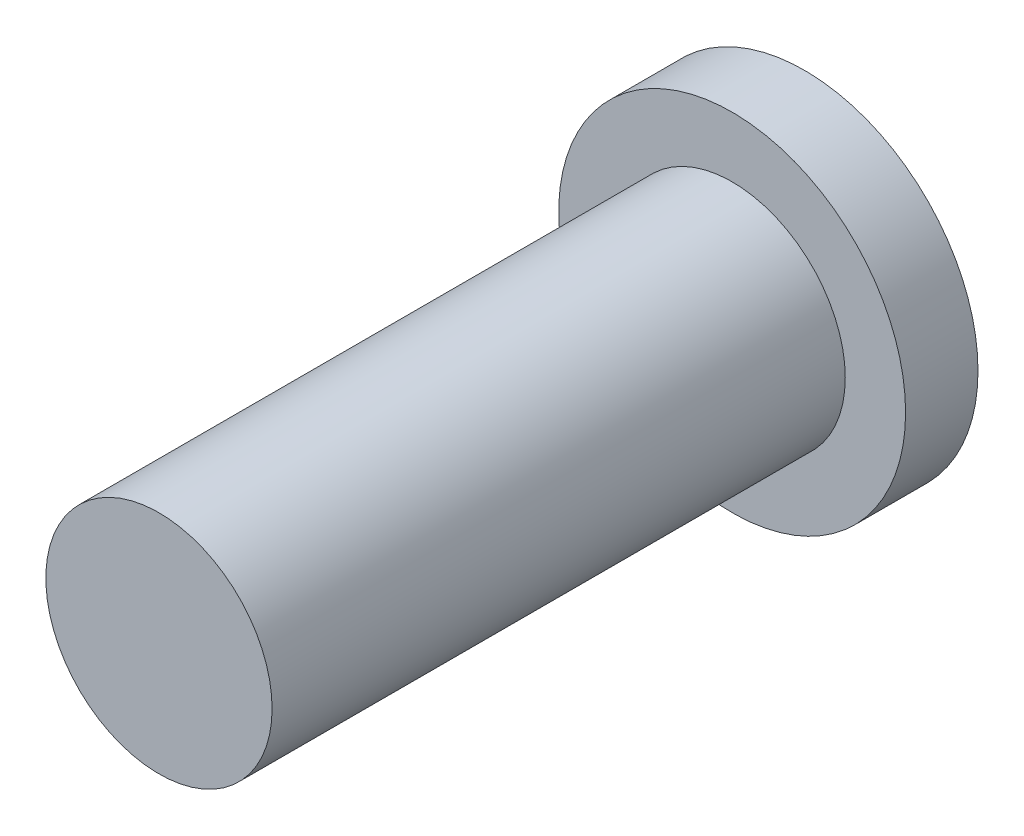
ISO-10303-21;
HEADER;
FILE_DESCRIPTION(('STEP AP214'),'2;1');
FILE_NAME('part.step','',(''),(''),'','','');
FILE_SCHEMA(('AUTOMOTIVE_DESIGN { 1 0 10303 214 1 1 1 1 }'));
ENDSEC;
DATA;
#1=APPLICATION_CONTEXT('core data for automotive mechanical design processes');
#2=APPLICATION_PROTOCOL_DEFINITION('international standard','automotive_design',2000,#1);
#3=PRODUCT_CONTEXT('',#1,'mechanical');
#4=PRODUCT('Part','Part','',(#3));
#5=PRODUCT_RELATED_PRODUCT_CATEGORY('part','',(#4));
#6=PRODUCT_DEFINITION_FORMATION('','',#4);
#7=PRODUCT_DEFINITION_CONTEXT('part definition',#1,'design');
#8=PRODUCT_DEFINITION('design','',#6,#7);
#9=PRODUCT_DEFINITION_SHAPE('','',#8);
#10=(LENGTH_UNIT() NAMED_UNIT(*) SI_UNIT(.MILLI.,.METRE.));
#11=(NAMED_UNIT(*) PLANE_ANGLE_UNIT() SI_UNIT($,.RADIAN.));
#12=(NAMED_UNIT(*) SI_UNIT($,.STERADIAN.) SOLID_ANGLE_UNIT());
#13=UNCERTAINTY_MEASURE_WITH_UNIT(LENGTH_MEASURE(1.E-05),#10,'distance_accuracy_value','');
#14=(GEOMETRIC_REPRESENTATION_CONTEXT(3) GLOBAL_UNCERTAINTY_ASSIGNED_CONTEXT((#13)) GLOBAL_UNIT_ASSIGNED_CONTEXT((#10,
#11,#12)) REPRESENTATION_CONTEXT('',''));
#15=CARTESIAN_POINT('',(0.,0.,0.));
#16=DIRECTION('',(0.,0.,1.));
#17=DIRECTION('',(1.,0.,0.));
#18=AXIS2_PLACEMENT_3D('',#15,#16,#17);
#19=CARTESIAN_POINT('',(0.,0.,0.6096));
#20=DIRECTION('',(0.,0.,1.));
#21=DIRECTION('',(1.,0.,0.));
#22=AXIS2_PLACEMENT_3D('',#19,#20,#21);
#23=PLANE('',#22);
#24=CARTESIAN_POINT('',(0.,0.,0.6096));
#25=DIRECTION('',(0.,0.,1.));
#26=DIRECTION('',(1.,0.,0.));
#27=AXIS2_PLACEMENT_3D('',#24,#25,#26);
#28=CIRCLE('',#27,1.4605);
#29=CARTESIAN_POINT('',(1.4605,0.,0.6096));
#30=VERTEX_POINT('',#29);
#31=EDGE_CURVE('E11',#30,#30,#28,.T.);
#32=ORIENTED_EDGE('',*,*,#31,.T.);
#33=EDGE_LOOP('',(#32));
#34=FACE_BOUND('',#33,.T.);
#35=CARTESIAN_POINT('',(0.,0.,0.6096));
#36=DIRECTION('',(0.,0.,1.));
#37=DIRECTION('',(1.,0.,0.));
#38=AXIS2_PLACEMENT_3D('',#35,#36,#37);
#39=CIRCLE('',#38,0.9525);
#40=CARTESIAN_POINT('',(0.9525,0.,0.6096));
#41=VERTEX_POINT('',#40);
#42=EDGE_CURVE('E189',#41,#41,#39,.T.);
#43=ORIENTED_EDGE('',*,*,#42,.F.);
#44=EDGE_LOOP('',(#43));
#45=FACE_BOUND('',#44,.T.);
#46=ADVANCED_FACE('F33',(#34,#45),#23,.T.);
#47=CARTESIAN_POINT('',(0.,0.,0.6096));
#48=DIRECTION('',(0.,0.,-1.));
#49=DIRECTION('',(-1.,0.,0.));
#50=AXIS2_PLACEMENT_3D('',#47,#48,#49);
#51=CYLINDRICAL_SURFACE('',#50,1.4605);
#52=ORIENTED_EDGE('',*,*,#31,.F.);
#53=EDGE_LOOP('',(#52));
#54=FACE_BOUND('',#53,.T.);
#55=CARTESIAN_POINT('',(0.,0.,0.));
#56=DIRECTION('',(0.,0.,1.));
#57=DIRECTION('',(1.,0.,0.));
#58=AXIS2_PLACEMENT_3D('',#55,#56,#57);
#59=CIRCLE('',#58,1.4605);
#60=CARTESIAN_POINT('',(1.4605,0.,0.));
#61=VERTEX_POINT('',#60);
#62=EDGE_CURVE('E37',#61,#61,#59,.T.);
#63=ORIENTED_EDGE('',*,*,#62,.T.);
#64=EDGE_LOOP('',(#63));
#65=FACE_BOUND('',#64,.T.);
#66=ADVANCED_FACE('F35',(#54,#65),#51,.T.);
#67=CARTESIAN_POINT('',(0.,0.,0.));
#68=DIRECTION('',(0.,0.,1.));
#69=DIRECTION('',(1.,0.,0.));
#70=AXIS2_PLACEMENT_3D('',#67,#68,#69);
#71=PLANE('',#70);
#72=DIRECTION('',(-1.,0.,0.));
#73=VECTOR('',#72,1.);
#74=CARTESIAN_POINT('',(0.5715,-0.1905,0.));
#75=LINE('',#74,#73);
#76=CARTESIAN_POINT('',(0.5715,-0.1905,0.));
#77=VERTEX_POINT('',#76);
#78=CARTESIAN_POINT('',(0.1905,-0.1905,0.));
#79=VERTEX_POINT('',#78);
#80=EDGE_CURVE('E158',#77,#79,#75,.T.);
#81=ORIENTED_EDGE('',*,*,#80,.F.);
#82=DIRECTION('',(0.,-1.,0.));
#83=VECTOR('',#82,1.);
#84=CARTESIAN_POINT('',(0.5715,0.1905,0.));
#85=LINE('',#84,#83);
#86=CARTESIAN_POINT('',(0.5715,0.1905,0.));
#87=VERTEX_POINT('',#86);
#88=EDGE_CURVE('E48',#87,#77,#85,.T.);
#89=ORIENTED_EDGE('',*,*,#88,.F.);
#90=DIRECTION('',(1.,0.,0.));
#91=VECTOR('',#90,1.);
#92=CARTESIAN_POINT('',(0.5715,0.1905,0.));
#93=LINE('',#92,#91);
#94=CARTESIAN_POINT('',(0.1905,0.1905,0.));
#95=VERTEX_POINT('',#94);
#96=EDGE_CURVE('E185',#95,#87,#93,.T.);
#97=ORIENTED_EDGE('',*,*,#96,.F.);
#98=DIRECTION('',(0.,-1.,0.));
#99=VECTOR('',#98,1.);
#100=CARTESIAN_POINT('',(0.1905,0.5715,0.));
#101=LINE('',#100,#99);
#102=CARTESIAN_POINT('',(0.1905,0.5715,0.));
#103=VERTEX_POINT('',#102);
#104=EDGE_CURVE('E183',#103,#95,#101,.T.);
#105=ORIENTED_EDGE('',*,*,#104,.F.);
#106=DIRECTION('',(1.,0.,0.));
#107=VECTOR('',#106,1.);
#108=CARTESIAN_POINT('',(0.1905,0.5715,0.));
#109=LINE('',#108,#107);
#110=CARTESIAN_POINT('',(-0.1905,0.5715,0.));
#111=VERTEX_POINT('',#110);
#112=EDGE_CURVE('E132',#111,#103,#109,.T.);
#113=ORIENTED_EDGE('',*,*,#112,.F.);
#114=DIRECTION('',(0.,1.,0.));
#115=VECTOR('',#114,1.);
#116=CARTESIAN_POINT('',(-0.1905,0.5715,0.));
#117=LINE('',#116,#115);
#118=CARTESIAN_POINT('',(-0.1905,0.1905,0.));
#119=VERTEX_POINT('',#118);
#120=EDGE_CURVE('E179',#119,#111,#117,.T.);
#121=ORIENTED_EDGE('',*,*,#120,.F.);
#122=DIRECTION('',(1.,0.,0.));
#123=VECTOR('',#122,1.);
#124=CARTESIAN_POINT('',(-0.1905,0.1905,0.));
#125=LINE('',#124,#123);
#126=CARTESIAN_POINT('',(-0.5715,0.1905,0.));
#127=VERTEX_POINT('',#126);
#128=EDGE_CURVE('E176',#127,#119,#125,.T.);
#129=ORIENTED_EDGE('',*,*,#128,.F.);
#130=DIRECTION('',(0.,1.,0.));
#131=VECTOR('',#130,1.);
#132=CARTESIAN_POINT('',(-0.5715,0.1905,0.));
#133=LINE('',#132,#131);
#134=CARTESIAN_POINT('',(-0.5715,-0.1905,0.));
#135=VERTEX_POINT('',#134);
#136=EDGE_CURVE('E173',#135,#127,#133,.T.);
#137=ORIENTED_EDGE('',*,*,#136,.F.);
#138=DIRECTION('',(-1.,0.,0.));
#139=VECTOR('',#138,1.);
#140=CARTESIAN_POINT('',(-0.1905,-0.1905,0.));
#141=LINE('',#140,#139);
#142=CARTESIAN_POINT('',(-0.1905,-0.1905,0.));
#143=VERTEX_POINT('',#142);
#144=EDGE_CURVE('E170',#143,#135,#141,.T.);
#145=ORIENTED_EDGE('',*,*,#144,.F.);
#146=DIRECTION('',(0.,1.,0.));
#147=VECTOR('',#146,1.);
#148=CARTESIAN_POINT('',(-0.1905,-0.1905,0.));
#149=LINE('',#148,#147);
#150=CARTESIAN_POINT('',(-0.1905,-0.5715,0.));
#151=VERTEX_POINT('',#150);
#152=EDGE_CURVE('E167',#151,#143,#149,.T.);
#153=ORIENTED_EDGE('',*,*,#152,.F.);
#154=DIRECTION('',(-1.,0.,0.));
#155=VECTOR('',#154,1.);
#156=CARTESIAN_POINT('',(0.1905,-0.5715,0.));
#157=LINE('',#156,#155);
#158=CARTESIAN_POINT('',(0.1905,-0.5715,0.));
#159=VERTEX_POINT('',#158);
#160=EDGE_CURVE('E164',#159,#151,#157,.T.);
#161=ORIENTED_EDGE('',*,*,#160,.F.);
#162=DIRECTION('',(0.,-1.,0.));
#163=VECTOR('',#162,1.);
#164=CARTESIAN_POINT('',(0.1905,-0.1905,0.));
#165=LINE('',#164,#163);
#166=EDGE_CURVE('E161',#79,#159,#165,.T.);
#167=ORIENTED_EDGE('',*,*,#166,.F.);
#168=EDGE_LOOP('',(#81,#89,#97,#105,#113,#121,#129,#137,#145,#153,#161,#167));
#169=FACE_BOUND('',#168,.T.);
#170=ORIENTED_EDGE('',*,*,#62,.F.);
#171=EDGE_LOOP('',(#170));
#172=FACE_BOUND('',#171,.T.);
#173=ADVANCED_FACE('F221',(#169,#172),#71,.F.);
#174=CARTESIAN_POINT('',(0.,0.,5.4356));
#175=DIRECTION('',(0.,0.,-1.));
#176=DIRECTION('',(-1.,0.,0.));
#177=AXIS2_PLACEMENT_3D('',#174,#175,#176);
#178=CYLINDRICAL_SURFACE('',#177,0.9525);
#179=CARTESIAN_POINT('',(0.,0.,5.4356));
#180=DIRECTION('',(0.,0.,1.));
#181=DIRECTION('',(1.,0.,0.));
#182=AXIS2_PLACEMENT_3D('',#179,#180,#181);
#183=CIRCLE('',#182,0.9525);
#184=CARTESIAN_POINT('',(0.9525,0.,5.4356));
#185=VERTEX_POINT('',#184);
#186=EDGE_CURVE('E207',#185,#185,#183,.T.);
#187=ORIENTED_EDGE('',*,*,#186,.F.);
#188=EDGE_LOOP('',(#187));
#189=FACE_BOUND('',#188,.T.);
#190=ORIENTED_EDGE('',*,*,#42,.T.);
#191=EDGE_LOOP('',(#190));
#192=FACE_BOUND('',#191,.T.);
#193=ADVANCED_FACE('F213',(#189,#192),#178,.T.);
#194=CARTESIAN_POINT('',(0.,0.,5.4356));
#195=DIRECTION('',(0.,0.,1.));
#196=DIRECTION('',(1.,0.,0.));
#197=AXIS2_PLACEMENT_3D('',#194,#195,#196);
#198=PLANE('',#197);
#199=ORIENTED_EDGE('',*,*,#186,.T.);
#200=EDGE_LOOP('',(#199));
#201=FACE_BOUND('',#200,.T.);
#202=ADVANCED_FACE('F230',(#201),#198,.T.);
#203=CARTESIAN_POINT('',(0.5715,0.1905,0.381));
#204=DIRECTION('',(1.,0.,0.));
#205=DIRECTION('',(0.,0.,-1.));
#206=AXIS2_PLACEMENT_3D('',#203,#204,#205);
#207=PLANE('',#206);
#208=ORIENTED_EDGE('',*,*,#88,.T.);
#209=DIRECTION('',(0.,0.,-1.));
#210=VECTOR('',#209,1.);
#211=CARTESIAN_POINT('',(0.5715,-0.1905,0.381));
#212=LINE('',#211,#210);
#213=CARTESIAN_POINT('',(0.5715,-0.1905,0.381));
#214=VERTEX_POINT('',#213);
#215=EDGE_CURVE('E96',#214,#77,#212,.T.);
#216=ORIENTED_EDGE('',*,*,#215,.F.);
#217=DIRECTION('',(0.,-1.,0.));
#218=VECTOR('',#217,1.);
#219=CARTESIAN_POINT('',(0.5715,0.1905,0.381));
#220=LINE('',#219,#218);
#221=CARTESIAN_POINT('',(0.5715,0.1905,0.381));
#222=VERTEX_POINT('',#221);
#223=EDGE_CURVE('E187',#222,#214,#220,.T.);
#224=ORIENTED_EDGE('',*,*,#223,.F.);
#225=DIRECTION('',(0.,0.,-1.));
#226=VECTOR('',#225,1.);
#227=CARTESIAN_POINT('',(0.5715,0.1905,0.381));
#228=LINE('',#227,#226);
#229=EDGE_CURVE('E56',#222,#87,#228,.T.);
#230=ORIENTED_EDGE('',*,*,#229,.T.);
#231=EDGE_LOOP('',(#208,#216,#224,#230));
#232=FACE_BOUND('',#231,.T.);
#233=ADVANCED_FACE('F272',(#232),#207,.F.);
#234=CARTESIAN_POINT('',(0.5715,0.1905,0.381));
#235=DIRECTION('',(0.,1.,0.));
#236=DIRECTION('',(-1.,0.,0.));
#237=AXIS2_PLACEMENT_3D('',#234,#235,#236);
#238=PLANE('',#237);
#239=ORIENTED_EDGE('',*,*,#96,.T.);
#240=ORIENTED_EDGE('',*,*,#229,.F.);
#241=DIRECTION('',(1.,0.,0.));
#242=VECTOR('',#241,1.);
#243=CARTESIAN_POINT('',(0.5715,0.1905,0.381));
#244=LINE('',#243,#242);
#245=CARTESIAN_POINT('',(0.1905,0.1905,0.381));
#246=VERTEX_POINT('',#245);
#247=EDGE_CURVE('E144',#246,#222,#244,.T.);
#248=ORIENTED_EDGE('',*,*,#247,.F.);
#249=DIRECTION('',(0.,0.,-1.));
#250=VECTOR('',#249,1.);
#251=CARTESIAN_POINT('',(0.1905,0.1905,0.381));
#252=LINE('',#251,#250);
#253=EDGE_CURVE('E136',#246,#95,#252,.T.);
#254=ORIENTED_EDGE('',*,*,#253,.T.);
#255=EDGE_LOOP('',(#239,#240,#248,#254));
#256=FACE_BOUND('',#255,.T.);
#257=ADVANCED_FACE('F270',(#256),#238,.F.);
#258=CARTESIAN_POINT('',(0.1905,0.5715,0.381));
#259=DIRECTION('',(1.,0.,0.));
#260=DIRECTION('',(0.,1.,0.));
#261=AXIS2_PLACEMENT_3D('',#258,#259,#260);
#262=PLANE('',#261);
#263=ORIENTED_EDGE('',*,*,#104,.T.);
#264=ORIENTED_EDGE('',*,*,#253,.F.);
#265=DIRECTION('',(0.,-1.,0.));
#266=VECTOR('',#265,1.);
#267=CARTESIAN_POINT('',(0.1905,0.5715,0.381));
#268=LINE('',#267,#266);
#269=CARTESIAN_POINT('',(0.1905,0.5715,0.381));
#270=VERTEX_POINT('',#269);
#271=EDGE_CURVE('E140',#270,#246,#268,.T.);
#272=ORIENTED_EDGE('',*,*,#271,.F.);
#273=DIRECTION('',(0.,0.,-1.));
#274=VECTOR('',#273,1.);
#275=CARTESIAN_POINT('',(0.1905,0.5715,0.381));
#276=LINE('',#275,#274);
#277=EDGE_CURVE('E125',#270,#103,#276,.T.);
#278=ORIENTED_EDGE('',*,*,#277,.T.);
#279=EDGE_LOOP('',(#263,#264,#272,#278));
#280=FACE_BOUND('',#279,.T.);
#281=ADVANCED_FACE('F141',(#280),#262,.F.);
#282=CARTESIAN_POINT('',(0.1905,0.5715,0.381));
#283=DIRECTION('',(0.,1.,0.));
#284=DIRECTION('',(0.,0.,1.));
#285=AXIS2_PLACEMENT_3D('',#282,#283,#284);
#286=PLANE('',#285);
#287=ORIENTED_EDGE('',*,*,#112,.T.);
#288=ORIENTED_EDGE('',*,*,#277,.F.);
#289=DIRECTION('',(1.,0.,0.));
#290=VECTOR('',#289,1.);
#291=CARTESIAN_POINT('',(0.1905,0.5715,0.381));
#292=LINE('',#291,#290);
#293=CARTESIAN_POINT('',(-0.1905,0.5715,0.381));
#294=VERTEX_POINT('',#293);
#295=EDGE_CURVE('E129',#294,#270,#292,.T.);
#296=ORIENTED_EDGE('',*,*,#295,.F.);
#297=DIRECTION('',(0.,0.,-1.));
#298=VECTOR('',#297,1.);
#299=CARTESIAN_POINT('',(-0.1905,0.5715,0.381));
#300=LINE('',#299,#298);
#301=EDGE_CURVE('E137',#294,#111,#300,.T.);
#302=ORIENTED_EDGE('',*,*,#301,.T.);
#303=EDGE_LOOP('',(#287,#288,#296,#302));
#304=FACE_BOUND('',#303,.T.);
#305=ADVANCED_FACE('F127',(#304),#286,.F.);
#306=CARTESIAN_POINT('',(-0.1905,0.5715,0.381));
#307=DIRECTION('',(-1.,0.,0.));
#308=DIRECTION('',(0.,-1.,0.));
#309=AXIS2_PLACEMENT_3D('',#306,#307,#308);
#310=PLANE('',#309);
#311=ORIENTED_EDGE('',*,*,#120,.T.);
#312=ORIENTED_EDGE('',*,*,#301,.F.);
#313=DIRECTION('',(0.,1.,0.));
#314=VECTOR('',#313,1.);
#315=CARTESIAN_POINT('',(-0.1905,0.5715,0.381));
#316=LINE('',#315,#314);
#317=CARTESIAN_POINT('',(-0.1905,0.1905,0.381));
#318=VERTEX_POINT('',#317);
#319=EDGE_CURVE('E150',#318,#294,#316,.T.);
#320=ORIENTED_EDGE('',*,*,#319,.F.);
#321=DIRECTION('',(0.,0.,-1.));
#322=VECTOR('',#321,1.);
#323=CARTESIAN_POINT('',(-0.1905,0.1905,0.381));
#324=LINE('',#323,#322);
#325=EDGE_CURVE('E192',#318,#119,#324,.T.);
#326=ORIENTED_EDGE('',*,*,#325,.T.);
#327=EDGE_LOOP('',(#311,#312,#320,#326));
#328=FACE_BOUND('',#327,.T.);
#329=ADVANCED_FACE('F269',(#328),#310,.F.);
#330=CARTESIAN_POINT('',(-0.1905,0.1905,0.381));
#331=DIRECTION('',(0.,1.,0.));
#332=DIRECTION('',(-1.,0.,0.));
#333=AXIS2_PLACEMENT_3D('',#330,#331,#332);
#334=PLANE('',#333);
#335=ORIENTED_EDGE('',*,*,#128,.T.);
#336=ORIENTED_EDGE('',*,*,#325,.F.);
#337=DIRECTION('',(1.,0.,0.));
#338=VECTOR('',#337,1.);
#339=CARTESIAN_POINT('',(-0.1905,0.1905,0.381));
#340=LINE('',#339,#338);
#341=CARTESIAN_POINT('',(-0.5715,0.1905,0.381));
#342=VERTEX_POINT('',#341);
#343=EDGE_CURVE('E152',#342,#318,#340,.T.);
#344=ORIENTED_EDGE('',*,*,#343,.F.);
#345=DIRECTION('',(0.,0.,-1.));
#346=VECTOR('',#345,1.);
#347=CARTESIAN_POINT('',(-0.5715,0.1905,0.381));
#348=LINE('',#347,#346);
#349=EDGE_CURVE('E194',#342,#127,#348,.T.);
#350=ORIENTED_EDGE('',*,*,#349,.T.);
#351=EDGE_LOOP('',(#335,#336,#344,#350));
#352=FACE_BOUND('',#351,.T.);
#353=ADVANCED_FACE('F265',(#352),#334,.F.);
#354=CARTESIAN_POINT('',(-0.5715,0.1905,0.381));
#355=DIRECTION('',(-1.,0.,0.));
#356=DIRECTION('',(0.,0.,1.));
#357=AXIS2_PLACEMENT_3D('',#354,#355,#356);
#358=PLANE('',#357);
#359=ORIENTED_EDGE('',*,*,#136,.T.);
#360=ORIENTED_EDGE('',*,*,#349,.F.);
#361=DIRECTION('',(0.,1.,0.));
#362=VECTOR('',#361,1.);
#363=CARTESIAN_POINT('',(-0.5715,0.1905,0.381));
#364=LINE('',#363,#362);
#365=CARTESIAN_POINT('',(-0.5715,-0.1905,0.381));
#366=VERTEX_POINT('',#365);
#367=EDGE_CURVE('E260',#366,#342,#364,.T.);
#368=ORIENTED_EDGE('',*,*,#367,.F.);
#369=DIRECTION('',(0.,0.,-1.));
#370=VECTOR('',#369,1.);
#371=CARTESIAN_POINT('',(-0.5715,-0.1905,0.381));
#372=LINE('',#371,#370);
#373=EDGE_CURVE('E196',#366,#135,#372,.T.);
#374=ORIENTED_EDGE('',*,*,#373,.T.);
#375=EDGE_LOOP('',(#359,#360,#368,#374));
#376=FACE_BOUND('',#375,.T.);
#377=ADVANCED_FACE('F288',(#376),#358,.F.);
#378=CARTESIAN_POINT('',(-0.1905,-0.1905,0.381));
#379=DIRECTION('',(0.,-1.,0.));
#380=DIRECTION('',(1.,0.,0.));
#381=AXIS2_PLACEMENT_3D('',#378,#379,#380);
#382=PLANE('',#381);
#383=ORIENTED_EDGE('',*,*,#144,.T.);
#384=ORIENTED_EDGE('',*,*,#373,.F.);
#385=DIRECTION('',(-1.,0.,0.));
#386=VECTOR('',#385,1.);
#387=CARTESIAN_POINT('',(-0.1905,-0.1905,0.381));
#388=LINE('',#387,#386);
#389=CARTESIAN_POINT('',(-0.1905,-0.1905,0.381));
#390=VERTEX_POINT('',#389);
#391=EDGE_CURVE('E257',#390,#366,#388,.T.);
#392=ORIENTED_EDGE('',*,*,#391,.F.);
#393=DIRECTION('',(0.,0.,-1.));
#394=VECTOR('',#393,1.);
#395=CARTESIAN_POINT('',(-0.1905,-0.1905,0.381));
#396=LINE('',#395,#394);
#397=EDGE_CURVE('E198',#390,#143,#396,.T.);
#398=ORIENTED_EDGE('',*,*,#397,.T.);
#399=EDGE_LOOP('',(#383,#384,#392,#398));
#400=FACE_BOUND('',#399,.T.);
#401=ADVANCED_FACE('F291',(#400),#382,.F.);
#402=CARTESIAN_POINT('',(-0.1905,-0.1905,0.381));
#403=DIRECTION('',(-1.,0.,0.));
#404=DIRECTION('',(0.,-1.,0.));
#405=AXIS2_PLACEMENT_3D('',#402,#403,#404);
#406=PLANE('',#405);
#407=ORIENTED_EDGE('',*,*,#152,.T.);
#408=ORIENTED_EDGE('',*,*,#397,.F.);
#409=DIRECTION('',(0.,1.,0.));
#410=VECTOR('',#409,1.);
#411=CARTESIAN_POINT('',(-0.1905,-0.1905,0.381));
#412=LINE('',#411,#410);
#413=CARTESIAN_POINT('',(-0.1905,-0.5715,0.381));
#414=VERTEX_POINT('',#413);
#415=EDGE_CURVE('E254',#414,#390,#412,.T.);
#416=ORIENTED_EDGE('',*,*,#415,.F.);
#417=DIRECTION('',(0.,0.,-1.));
#418=VECTOR('',#417,1.);
#419=CARTESIAN_POINT('',(-0.1905,-0.5715,0.381));
#420=LINE('',#419,#418);
#421=EDGE_CURVE('E200',#414,#151,#420,.T.);
#422=ORIENTED_EDGE('',*,*,#421,.T.);
#423=EDGE_LOOP('',(#407,#408,#416,#422));
#424=FACE_BOUND('',#423,.T.);
#425=ADVANCED_FACE('F295',(#424),#406,.F.);
#426=CARTESIAN_POINT('',(0.1905,-0.5715,0.381));
#427=DIRECTION('',(0.,-1.,0.));
#428=DIRECTION('',(0.,0.,-1.));
#429=AXIS2_PLACEMENT_3D('',#426,#427,#428);
#430=PLANE('',#429);
#431=ORIENTED_EDGE('',*,*,#160,.T.);
#432=ORIENTED_EDGE('',*,*,#421,.F.);
#433=DIRECTION('',(-1.,0.,0.));
#434=VECTOR('',#433,1.);
#435=CARTESIAN_POINT('',(0.1905,-0.5715,0.381));
#436=LINE('',#435,#434);
#437=CARTESIAN_POINT('',(0.1905,-0.5715,0.381));
#438=VERTEX_POINT('',#437);
#439=EDGE_CURVE('E251',#438,#414,#436,.T.);
#440=ORIENTED_EDGE('',*,*,#439,.F.);
#441=DIRECTION('',(0.,0.,-1.));
#442=VECTOR('',#441,1.);
#443=CARTESIAN_POINT('',(0.1905,-0.5715,0.381));
#444=LINE('',#443,#442);
#445=EDGE_CURVE('E202',#438,#159,#444,.T.);
#446=ORIENTED_EDGE('',*,*,#445,.T.);
#447=EDGE_LOOP('',(#431,#432,#440,#446));
#448=FACE_BOUND('',#447,.T.);
#449=ADVANCED_FACE('F299',(#448),#430,.F.);
#450=CARTESIAN_POINT('',(0.1905,-0.1905,0.381));
#451=DIRECTION('',(1.,0.,0.));
#452=DIRECTION('',(0.,1.,0.));
#453=AXIS2_PLACEMENT_3D('',#450,#451,#452);
#454=PLANE('',#453);
#455=ORIENTED_EDGE('',*,*,#166,.T.);
#456=ORIENTED_EDGE('',*,*,#445,.F.);
#457=DIRECTION('',(0.,-1.,0.));
#458=VECTOR('',#457,1.);
#459=CARTESIAN_POINT('',(0.1905,-0.1905,0.381));
#460=LINE('',#459,#458);
#461=CARTESIAN_POINT('',(0.1905,-0.1905,0.381));
#462=VERTEX_POINT('',#461);
#463=EDGE_CURVE('E246',#462,#438,#460,.T.);
#464=ORIENTED_EDGE('',*,*,#463,.F.);
#465=DIRECTION('',(0.,0.,-1.));
#466=VECTOR('',#465,1.);
#467=CARTESIAN_POINT('',(0.1905,-0.1905,0.381));
#468=LINE('',#467,#466);
#469=EDGE_CURVE('E204',#462,#79,#468,.T.);
#470=ORIENTED_EDGE('',*,*,#469,.T.);
#471=EDGE_LOOP('',(#455,#456,#464,#470));
#472=FACE_BOUND('',#471,.T.);
#473=ADVANCED_FACE('F303',(#472),#454,.F.);
#474=CARTESIAN_POINT('',(0.5715,-0.1905,0.381));
#475=DIRECTION('',(0.,-1.,0.));
#476=DIRECTION('',(1.,0.,0.));
#477=AXIS2_PLACEMENT_3D('',#474,#475,#476);
#478=PLANE('',#477);
#479=ORIENTED_EDGE('',*,*,#80,.T.);
#480=ORIENTED_EDGE('',*,*,#469,.F.);
#481=DIRECTION('',(-1.,0.,0.));
#482=VECTOR('',#481,1.);
#483=CARTESIAN_POINT('',(0.5715,-0.1905,0.381));
#484=LINE('',#483,#482);
#485=EDGE_CURVE('E244',#214,#462,#484,.T.);
#486=ORIENTED_EDGE('',*,*,#485,.F.);
#487=ORIENTED_EDGE('',*,*,#215,.T.);
#488=EDGE_LOOP('',(#479,#480,#486,#487));
#489=FACE_BOUND('',#488,.T.);
#490=ADVANCED_FACE('F241',(#489),#478,.F.);
#491=CARTESIAN_POINT('',(0.5715,-0.5715,0.381));
#492=DIRECTION('',(0.,0.,-1.));
#493=DIRECTION('',(-1.,0.,0.));
#494=AXIS2_PLACEMENT_3D('',#491,#492,#493);
#495=PLANE('',#494);
#496=ORIENTED_EDGE('',*,*,#223,.T.);
#497=ORIENTED_EDGE('',*,*,#485,.T.);
#498=ORIENTED_EDGE('',*,*,#463,.T.);
#499=ORIENTED_EDGE('',*,*,#439,.T.);
#500=ORIENTED_EDGE('',*,*,#415,.T.);
#501=ORIENTED_EDGE('',*,*,#391,.T.);
#502=ORIENTED_EDGE('',*,*,#367,.T.);
#503=ORIENTED_EDGE('',*,*,#343,.T.);
#504=ORIENTED_EDGE('',*,*,#319,.T.);
#505=ORIENTED_EDGE('',*,*,#295,.T.);
#506=ORIENTED_EDGE('',*,*,#271,.T.);
#507=ORIENTED_EDGE('',*,*,#247,.T.);
#508=EDGE_LOOP('',(#496,#497,#498,#499,#500,#501,#502,#503,#504,#505,#506,#507));
#509=FACE_BOUND('',#508,.T.);
#510=ADVANCED_FACE('F147',(#509),#495,.T.);
#511=CLOSED_SHELL('',(#46,#66,#173,#193,#202,#233,#257,#281,#305,#329,#353,#377,#401,#425,#449,
#473,#490,#510));
#512=MANIFOLD_SOLID_BREP('B2',#511);
#513=ADVANCED_BREP_SHAPE_REPRESENTATION('',(#18,#512),#14);
#514=SHAPE_DEFINITION_REPRESENTATION(#9,#513);
ENDSEC;
END-ISO-10303-21;
